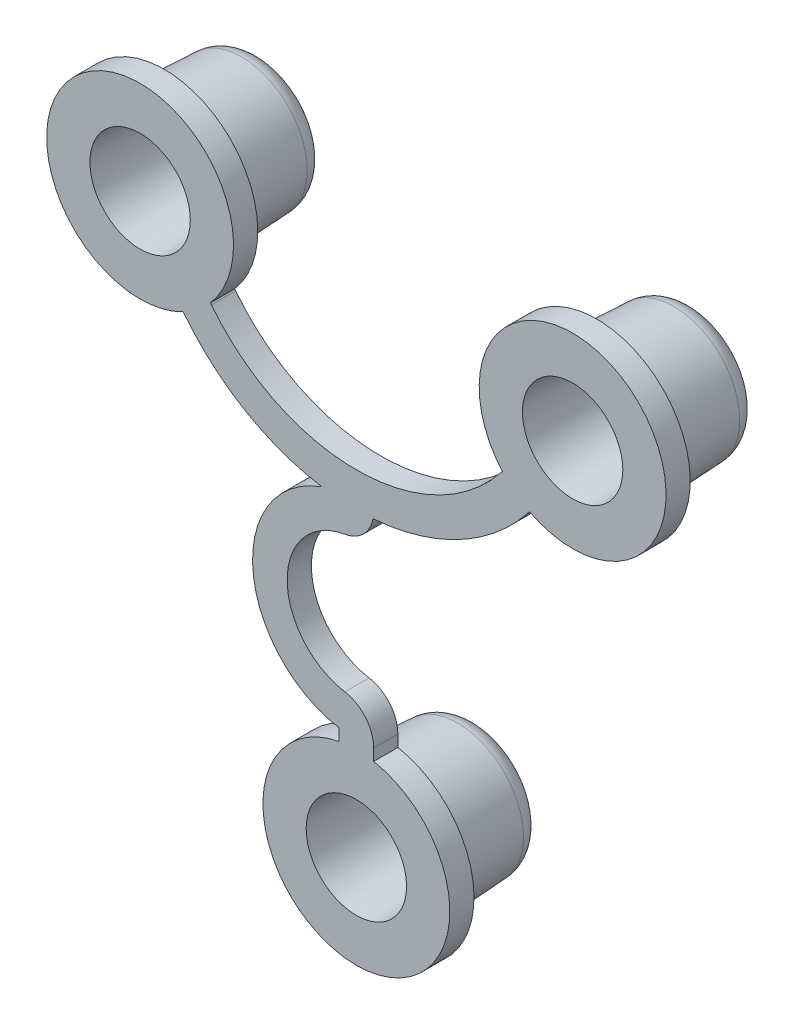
ISO-10303-21;
HEADER;
FILE_DESCRIPTION(('STEP AP214'),'2;1');
FILE_NAME('part.step','',(''),(''),'','','');
FILE_SCHEMA(('AUTOMOTIVE_DESIGN { 1 0 10303 214 1 1 1 1 }'));
ENDSEC;
DATA;
#1=APPLICATION_CONTEXT('core data for automotive mechanical design processes');
#2=APPLICATION_PROTOCOL_DEFINITION('international standard','automotive_design',2000,#1);
#3=PRODUCT_CONTEXT('',#1,'mechanical');
#4=PRODUCT('Part','Part','',(#3));
#5=PRODUCT_RELATED_PRODUCT_CATEGORY('part','',(#4));
#6=PRODUCT_DEFINITION_FORMATION('','',#4);
#7=PRODUCT_DEFINITION_CONTEXT('part definition',#1,'design');
#8=PRODUCT_DEFINITION('design','',#6,#7);
#9=PRODUCT_DEFINITION_SHAPE('','',#8);
#10=(LENGTH_UNIT() NAMED_UNIT(*) SI_UNIT(.MILLI.,.METRE.));
#11=(NAMED_UNIT(*) PLANE_ANGLE_UNIT() SI_UNIT($,.RADIAN.));
#12=(NAMED_UNIT(*) SI_UNIT($,.STERADIAN.) SOLID_ANGLE_UNIT());
#13=UNCERTAINTY_MEASURE_WITH_UNIT(LENGTH_MEASURE(1.E-05),#10,'distance_accuracy_value','');
#14=(GEOMETRIC_REPRESENTATION_CONTEXT(3) GLOBAL_UNCERTAINTY_ASSIGNED_CONTEXT((#13)) GLOBAL_UNIT_ASSIGNED_CONTEXT((#10,
#11,#12)) REPRESENTATION_CONTEXT('',''));
#15=CARTESIAN_POINT('',(0.,0.,0.));
#16=DIRECTION('',(0.,0.,1.));
#17=DIRECTION('',(1.,0.,0.));
#18=AXIS2_PLACEMENT_3D('',#15,#16,#17);
#19=CARTESIAN_POINT('',(-1.,17.8160797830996,14.9412181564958));
#20=DIRECTION('',(0.,0.,-1.));
#21=DIRECTION('',(0.,1.,0.));
#22=AXIS2_PLACEMENT_3D('',#19,#20,#21);
#23=CYLINDRICAL_SURFACE('',#22,2.);
#24=CARTESIAN_POINT('',(-1.,17.8160797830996,-1.4));
#25=DIRECTION('',(0.,0.,-1.));
#26=DIRECTION('',(-1.,0.,0.));
#27=AXIS2_PLACEMENT_3D('',#24,#25,#26);
#28=CIRCLE('',#27,2.);
#29=CARTESIAN_POINT('',(0.963698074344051,17.4367515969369,-1.4));
#30=VERTEX_POINT('',#29);
#31=CARTESIAN_POINT('',(-0.666666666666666,15.8440531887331,-1.4));
#32=VERTEX_POINT('',#31);
#33=EDGE_CURVE('E207',#30,#32,#28,.T.);
#34=ORIENTED_EDGE('',*,*,#33,.F.);
#35=DIRECTION('',(0.,0.,-1.));
#36=VECTOR('',#35,1.);
#37=CARTESIAN_POINT('',(0.963698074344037,17.4367515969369,-0.699999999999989));
#38=LINE('',#37,#36);
#39=CARTESIAN_POINT('',(0.963698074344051,17.4367515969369,0.));
#40=VERTEX_POINT('',#39);
#41=EDGE_CURVE('E171',#30,#40,#38,.F.);
#42=ORIENTED_EDGE('',*,*,#41,.T.);
#43=CARTESIAN_POINT('',(-1.,17.8160797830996,0.));
#44=DIRECTION('',(0.,0.,1.));
#45=DIRECTION('',(1.,0.,0.));
#46=AXIS2_PLACEMENT_3D('',#43,#44,#45);
#47=CIRCLE('',#46,2.);
#48=CARTESIAN_POINT('',(-0.666666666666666,15.8440531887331,0.));
#49=VERTEX_POINT('',#48);
#50=EDGE_CURVE('E228',#40,#49,#47,.F.);
#51=ORIENTED_EDGE('',*,*,#50,.T.);
#52=DIRECTION('',(0.,0.,-1.));
#53=VECTOR('',#52,1.);
#54=CARTESIAN_POINT('',(-0.666666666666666,15.8440531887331,14.9412181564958));
#55=LINE('',#54,#53);
#56=EDGE_CURVE('E220',#49,#32,#55,.T.);
#57=ORIENTED_EDGE('',*,*,#56,.T.);
#58=EDGE_LOOP('',(#34,#42,#51,#57));
#59=FACE_BOUND('',#58,.T.);
#60=ADVANCED_FACE('F36',(#59),#23,.T.);
#61=CARTESIAN_POINT('',(0.,11.9,14.9412181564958));
#62=DIRECTION('',(0.,0.,-1.));
#63=DIRECTION('',(0.,1.,0.));
#64=AXIS2_PLACEMENT_3D('',#61,#62,#63);
#65=CYLINDRICAL_SURFACE('',#64,6.);
#66=DIRECTION('',(0.,0.,-1.));
#67=VECTOR('',#66,1.);
#68=CARTESIAN_POINT('',(-1.99570021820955,17.5583726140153,-0.699999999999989));
#69=LINE('',#68,#67);
#70=CARTESIAN_POINT('',(-1.99570021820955,17.5583726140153,-1.4));
#71=VERTEX_POINT('',#70);
#72=CARTESIAN_POINT('',(-1.99570021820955,17.5583726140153,0.));
#73=VERTEX_POINT('',#72);
#74=EDGE_CURVE('E271',#71,#73,#69,.F.);
#75=ORIENTED_EDGE('',*,*,#74,.F.);
#76=CARTESIAN_POINT('',(0.,11.9,-1.4));
#77=DIRECTION('',(0.,0.,-1.));
#78=DIRECTION('',(-1.,0.,0.));
#79=AXIS2_PLACEMENT_3D('',#76,#77,#78);
#80=CIRCLE('',#79,6.);
#81=CARTESIAN_POINT('',(-1.,5.98392021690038,-1.4));
#82=VERTEX_POINT('',#81);
#83=EDGE_CURVE('E217',#71,#82,#80,.F.);
#84=ORIENTED_EDGE('',*,*,#83,.T.);
#85=DIRECTION('',(0.,0.,-1.));
#86=VECTOR('',#85,1.);
#87=CARTESIAN_POINT('',(-1.,5.98392021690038,14.9412181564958));
#88=LINE('',#87,#86);
#89=CARTESIAN_POINT('',(-1.,5.98392021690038,0.));
#90=VERTEX_POINT('',#89);
#91=EDGE_CURVE('E219',#90,#82,#88,.T.);
#92=ORIENTED_EDGE('',*,*,#91,.F.);
#93=CARTESIAN_POINT('',(0.,11.9,0.));
#94=DIRECTION('',(0.,0.,1.));
#95=DIRECTION('',(1.,0.,0.));
#96=AXIS2_PLACEMENT_3D('',#93,#94,#95);
#97=CIRCLE('',#96,6.);
#98=EDGE_CURVE('E212',#73,#90,#97,.T.);
#99=ORIENTED_EDGE('',*,*,#98,.F.);
#100=EDGE_LOOP('',(#75,#84,#92,#99));
#101=FACE_BOUND('',#100,.T.);
#102=ADVANCED_FACE('F355',(#101),#65,.T.);
#103=CARTESIAN_POINT('',(0.,0.,0.));
#104=DIRECTION('',(0.,0.,1.));
#105=DIRECTION('',(1.,0.,0.));
#106=AXIS2_PLACEMENT_3D('',#103,#104,#105);
#107=CONICAL_SURFACE('',#106,2.90108311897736,0.0523598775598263);
#108=CARTESIAN_POINT('',(0.,0.,-5.8));
#109=DIRECTION('',(0.,0.,-1.));
#110=DIRECTION('',(-1.,0.,0.));
#111=AXIS2_PLACEMENT_3D('',#108,#109,#110);
#112=CIRCLE('',#111,2.59711799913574);
#113=CARTESIAN_POINT('',(-2.59711799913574,0.,-5.8));
#114=VERTEX_POINT('',#113);
#115=EDGE_CURVE('E268',#114,#114,#112,.T.);
#116=ORIENTED_EDGE('',*,*,#115,.T.);
#117=EDGE_LOOP('',(#116));
#118=FACE_BOUND('',#117,.T.);
#119=CARTESIAN_POINT('',(0.,0.,0.));
#120=DIRECTION('',(0.,0.,-1.));
#121=DIRECTION('',(-1.,0.,0.));
#122=AXIS2_PLACEMENT_3D('',#119,#120,#121);
#123=CIRCLE('',#122,2.90108311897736);
#124=CARTESIAN_POINT('',(-2.90108311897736,0.,0.));
#125=VERTEX_POINT('',#124);
#126=EDGE_CURVE('E248',#125,#125,#123,.T.);
#127=ORIENTED_EDGE('',*,*,#126,.F.);
#128=EDGE_LOOP('',(#127));
#129=FACE_BOUND('',#128,.T.);
#130=ADVANCED_FACE('F38',(#118,#129),#107,.F.);
#131=CARTESIAN_POINT('',(2.59711799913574,0.,-5.8));
#132=DIRECTION('',(0.,0.,1.));
#133=DIRECTION('',(1.,0.,0.));
#134=AXIS2_PLACEMENT_3D('',#131,#132,#133);
#135=PLANE('',#134);
#136=ORIENTED_EDGE('',*,*,#115,.F.);
#137=EDGE_LOOP('',(#136));
#138=FACE_BOUND('',#137,.T.);
#139=ADVANCED_FACE('F401',(#138),#135,.T.);
#140=CARTESIAN_POINT('',(0.,0.,-7.));
#141=DIRECTION('',(0.,0.,-1.));
#142=DIRECTION('',(-1.,0.,0.));
#143=AXIS2_PLACEMENT_3D('',#140,#141,#142);
#144=PLANE('',#143);
#145=CARTESIAN_POINT('',(0.,0.,-7.));
#146=DIRECTION('',(0.,0.,-1.));
#147=DIRECTION('',(-1.,0.,0.));
#148=AXIS2_PLACEMENT_3D('',#145,#146,#147);
#149=CIRCLE('',#148,2.59711799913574);
#150=CARTESIAN_POINT('',(-2.59711799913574,0.,-7.));
#151=VERTEX_POINT('',#150);
#152=EDGE_CURVE('E265',#151,#151,#149,.T.);
#153=ORIENTED_EDGE('',*,*,#152,.T.);
#154=EDGE_LOOP('',(#153));
#155=FACE_BOUND('',#154,.T.);
#156=ADVANCED_FACE('F398',(#155),#144,.T.);
#157=CARTESIAN_POINT('',(0.,0.,-5.8));
#158=DIRECTION('',(0.,0.,-1.));
#159=DIRECTION('',(-1.,0.,0.));
#160=AXIS2_PLACEMENT_3D('',#157,#158,#159);
#161=TOROIDAL_SURFACE('',#160,2.59711799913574,1.2);
#162=CARTESIAN_POINT('',(0.,0.,-5.86280314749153));
#163=DIRECTION('',(0.,0.,-1.));
#164=DIRECTION('',(-1.,0.,0.));
#165=AXIS2_PLACEMENT_3D('',#162,#163,#164);
#166=CIRCLE('',#165,3.79547344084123);
#167=CARTESIAN_POINT('',(-3.79547344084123,0.,-5.86280314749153));
#168=VERTEX_POINT('',#167);
#169=EDGE_CURVE('E262',#168,#168,#166,.T.);
#170=ORIENTED_EDGE('',*,*,#169,.T.);
#171=EDGE_LOOP('',(#170));
#172=FACE_BOUND('',#171,.T.);
#173=ORIENTED_EDGE('',*,*,#152,.F.);
#174=EDGE_LOOP('',(#173));
#175=FACE_BOUND('',#174,.T.);
#176=ADVANCED_FACE('F394',(#172,#175),#161,.T.);
#177=CARTESIAN_POINT('',(0.,0.,-5.86280314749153));
#178=DIRECTION('',(0.,0.,1.));
#179=DIRECTION('',(1.,0.,0.));
#180=AXIS2_PLACEMENT_3D('',#177,#178,#179);
#181=CONICAL_SURFACE('',#180,3.79547344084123,0.0523598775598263);
#182=CARTESIAN_POINT('',(0.,0.,-1.87383202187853));
#183=DIRECTION('',(0.,0.,-1.));
#184=DIRECTION('',(-1.,0.,0.));
#185=AXIS2_PLACEMENT_3D('',#182,#183,#184);
#186=CIRCLE('',#185,4.00452655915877);
#187=CARTESIAN_POINT('',(-4.00452655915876,0.,-1.87383202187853));
#188=VERTEX_POINT('',#187);
#189=EDGE_CURVE('E259',#188,#188,#186,.T.);
#190=ORIENTED_EDGE('',*,*,#189,.T.);
#191=EDGE_LOOP('',(#190));
#192=FACE_BOUND('',#191,.T.);
#193=ORIENTED_EDGE('',*,*,#169,.F.);
#194=EDGE_LOOP('',(#193));
#195=FACE_BOUND('',#194,.T.);
#196=ADVANCED_FACE('F390',(#192,#195),#181,.T.);
#197=CARTESIAN_POINT('',(0.,0.,-1.9));
#198=DIRECTION('',(0.,0.,-1.));
#199=DIRECTION('',(-1.,0.,0.));
#200=AXIS2_PLACEMENT_3D('',#197,#198,#199);
#201=TOROIDAL_SURFACE('',#200,4.50384132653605,0.5);
#202=CARTESIAN_POINT('',(0.,0.,-1.4));
#203=DIRECTION('',(0.,0.,-1.));
#204=DIRECTION('',(-1.,0.,0.));
#205=AXIS2_PLACEMENT_3D('',#202,#203,#204);
#206=CIRCLE('',#205,4.50384132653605);
#207=CARTESIAN_POINT('',(-4.50384132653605,0.,-1.4));
#208=VERTEX_POINT('',#207);
#209=EDGE_CURVE('E256',#208,#208,#206,.T.);
#210=ORIENTED_EDGE('',*,*,#209,.T.);
#211=EDGE_LOOP('',(#210));
#212=FACE_BOUND('',#211,.T.);
#213=ORIENTED_EDGE('',*,*,#189,.F.);
#214=EDGE_LOOP('',(#213));
#215=FACE_BOUND('',#214,.T.);
#216=ADVANCED_FACE('F387',(#212,#215),#201,.F.);
#217=CARTESIAN_POINT('',(4.50384132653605,0.,-1.4));
#218=DIRECTION('',(0.,0.,-1.));
#219=DIRECTION('',(-1.,0.,0.));
#220=AXIS2_PLACEMENT_3D('',#217,#218,#219);
#221=PLANE('',#220);
#222=DIRECTION('',(0.617691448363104,0.78642054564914,0.));
#223=VECTOR('',#222,1.);
#224=CARTESIAN_POINT('',(8.37804563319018,23.4728825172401,-1.4));
#225=LINE('',#224,#223);
#226=CARTESIAN_POINT('',(8.37804563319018,23.4728825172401,-1.4));
#227=VERTEX_POINT('',#226);
#228=CARTESIAN_POINT('',(8.43573822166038,23.5463344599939,-1.4));
#229=VERTEX_POINT('',#228);
#230=EDGE_CURVE('E178',#227,#229,#225,.T.);
#231=ORIENTED_EDGE('',*,*,#230,.T.);
#232=CARTESIAN_POINT('',(12.5,27.1018620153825,-1.4));
#233=DIRECTION('',(0.,0.,-1.));
#234=DIRECTION('',(0.819152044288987,-0.573576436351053,0.));
#235=AXIS2_PLACEMENT_3D('',#232,#233,#234);
#236=CIRCLE('',#235,5.4);
#237=CARTESIAN_POINT('',(10.0085793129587,22.3109515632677,-1.4));
#238=VERTEX_POINT('',#237);
#239=EDGE_CURVE('E155',#229,#238,#236,.T.);
#240=ORIENTED_EDGE('',*,*,#239,.T.);
#241=DIRECTION('',(0.617691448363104,0.78642054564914,0.));
#242=VECTOR('',#241,1.);
#243=CARTESIAN_POINT('',(9.95088672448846,22.2374996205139,-1.4));
#244=LINE('',#243,#242);
#245=CARTESIAN_POINT('',(9.95088672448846,22.2374996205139,-1.4));
#246=VERTEX_POINT('',#245);
#247=EDGE_CURVE('E166',#246,#238,#244,.T.);
#248=ORIENTED_EDGE('',*,*,#247,.F.);
#249=CARTESIAN_POINT('',(0.,30.0533910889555,-1.4));
#250=DIRECTION('',(0.,0.,-1.));
#251=DIRECTION('',(-1.,0.,0.));
#252=AXIS2_PLACEMENT_3D('',#249,#250,#251);
#253=CIRCLE('',#252,12.6533910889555);
#254=EDGE_CURVE('E200',#30,#246,#253,.F.);
#255=ORIENTED_EDGE('',*,*,#254,.F.);
#256=ORIENTED_EDGE('',*,*,#33,.T.);
#257=CARTESIAN_POINT('',(0.,11.9,-1.4));
#258=DIRECTION('',(0.,0.,-1.));
#259=DIRECTION('',(-1.,0.,0.));
#260=AXIS2_PLACEMENT_3D('',#257,#258,#259);
#261=CIRCLE('',#260,4.);
#262=CARTESIAN_POINT('',(-0.666666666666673,7.95594681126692,-1.4));
#263=VERTEX_POINT('',#262);
#264=EDGE_CURVE('E213',#32,#263,#261,.F.);
#265=ORIENTED_EDGE('',*,*,#264,.T.);
#266=CARTESIAN_POINT('',(-1.,5.98392021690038,-1.4));
#267=DIRECTION('',(0.,0.,-1.));
#268=DIRECTION('',(-1.,0.,0.));
#269=AXIS2_PLACEMENT_3D('',#266,#267,#268);
#270=CIRCLE('',#269,2.);
#271=CARTESIAN_POINT('',(1.,5.98392021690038,-1.4));
#272=VERTEX_POINT('',#271);
#273=EDGE_CURVE('E209',#263,#272,#270,.T.);
#274=ORIENTED_EDGE('',*,*,#273,.T.);
#275=DIRECTION('',(0.,-1.,0.));
#276=VECTOR('',#275,1.);
#277=CARTESIAN_POINT('',(1.,5.4,-1.4));
#278=LINE('',#277,#276);
#279=CARTESIAN_POINT('',(1.,5.30659966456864,-1.4));
#280=VERTEX_POINT('',#279);
#281=EDGE_CURVE('E204',#272,#280,#278,.T.);
#282=ORIENTED_EDGE('',*,*,#281,.T.);
#283=CARTESIAN_POINT('',(0.,0.,-1.4));
#284=DIRECTION('',(0.,0.,-1.));
#285=DIRECTION('',(-1.,0.,0.));
#286=AXIS2_PLACEMENT_3D('',#283,#284,#285);
#287=CIRCLE('',#286,5.4);
#288=CARTESIAN_POINT('',(-1.,5.30659966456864,-1.4));
#289=VERTEX_POINT('',#288);
#290=EDGE_CURVE('E253',#280,#289,#287,.T.);
#291=ORIENTED_EDGE('',*,*,#290,.T.);
#292=DIRECTION('',(0.,-1.,0.));
#293=VECTOR('',#292,1.);
#294=CARTESIAN_POINT('',(-1.,5.4,-1.4));
#295=LINE('',#294,#293);
#296=EDGE_CURVE('E208',#82,#289,#295,.T.);
#297=ORIENTED_EDGE('',*,*,#296,.F.);
#298=ORIENTED_EDGE('',*,*,#83,.F.);
#299=CARTESIAN_POINT('',(-9.95088672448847,22.2374996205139,-1.4));
#300=VERTEX_POINT('',#299);
#301=EDGE_CURVE('E202',#300,#71,#253,.F.);
#302=ORIENTED_EDGE('',*,*,#301,.F.);
#303=DIRECTION('',(0.617691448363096,-0.786420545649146,0.));
#304=VECTOR('',#303,1.);
#305=CARTESIAN_POINT('',(-9.95088672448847,22.2374996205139,-1.4));
#306=LINE('',#305,#304);
#307=CARTESIAN_POINT('',(-10.0085793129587,22.3109515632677,-1.4));
#308=VERTEX_POINT('',#307);
#309=EDGE_CURVE('E196',#308,#300,#306,.T.);
#310=ORIENTED_EDGE('',*,*,#309,.F.);
#311=CARTESIAN_POINT('',(-12.5,27.1018620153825,-1.4));
#312=DIRECTION('',(0.,0.,-1.));
#313=DIRECTION('',(0.819152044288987,0.573576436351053,0.));
#314=AXIS2_PLACEMENT_3D('',#311,#312,#313);
#315=CIRCLE('',#314,5.4);
#316=CARTESIAN_POINT('',(-8.43573822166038,23.5463344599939,-1.4));
#317=VERTEX_POINT('',#316);
#318=EDGE_CURVE('E285',#308,#317,#315,.T.);
#319=ORIENTED_EDGE('',*,*,#318,.T.);
#320=DIRECTION('',(0.617691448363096,-0.786420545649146,0.));
#321=VECTOR('',#320,1.);
#322=CARTESIAN_POINT('',(-8.37804563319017,23.4728825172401,-1.4));
#323=LINE('',#322,#321);
#324=CARTESIAN_POINT('',(-8.37804563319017,23.4728825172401,-1.4));
#325=VERTEX_POINT('',#324);
#326=EDGE_CURVE('E291',#317,#325,#323,.T.);
#327=ORIENTED_EDGE('',*,*,#326,.T.);
#328=CARTESIAN_POINT('',(0.,30.0533910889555,-1.4));
#329=DIRECTION('',(0.,0.,-1.));
#330=DIRECTION('',(-1.,0.,0.));
#331=AXIS2_PLACEMENT_3D('',#328,#329,#330);
#332=CIRCLE('',#331,10.6533910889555);
#333=EDGE_CURVE('E183',#325,#227,#332,.F.);
#334=ORIENTED_EDGE('',*,*,#333,.T.);
#335=EDGE_LOOP('',(#231,#240,#248,#255,#256,#265,#274,#282,#291,#297,#298,#302,#310,#319,#327,#334));
#336=FACE_BOUND('',#335,.T.);
#337=ORIENTED_EDGE('',*,*,#209,.F.);
#338=EDGE_LOOP('',(#337));
#339=FACE_BOUND('',#338,.T.);
#340=CARTESIAN_POINT('',(-12.5,27.1018620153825,-1.4));
#341=DIRECTION('',(0.,0.,-1.));
#342=DIRECTION('',(0.819152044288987,0.573576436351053,0.));
#343=AXIS2_PLACEMENT_3D('',#340,#341,#342);
#344=CIRCLE('',#343,4.50384132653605);
#345=CARTESIAN_POINT('',(-8.81066917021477,29.6851592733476,-1.4));
#346=VERTEX_POINT('',#345);
#347=EDGE_CURVE('E310',#346,#346,#344,.T.);
#348=ORIENTED_EDGE('',*,*,#347,.F.);
#349=EDGE_LOOP('',(#348));
#350=FACE_BOUND('',#349,.T.);
#351=CARTESIAN_POINT('',(12.5,27.1018620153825,-1.4));
#352=DIRECTION('',(0.,0.,-1.));
#353=DIRECTION('',(0.819152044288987,-0.573576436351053,0.));
#354=AXIS2_PLACEMENT_3D('',#351,#352,#353);
#355=CIRCLE('',#354,4.50384132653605);
#356=CARTESIAN_POINT('',(16.1893308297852,24.5185647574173,-1.4));
#357=VERTEX_POINT('',#356);
#358=EDGE_CURVE('E331',#357,#357,#355,.T.);
#359=ORIENTED_EDGE('',*,*,#358,.F.);
#360=EDGE_LOOP('',(#359));
#361=FACE_BOUND('',#360,.T.);
#362=ADVANCED_FACE('F283',(#336,#339,#350,#361),#221,.T.);
#363=CARTESIAN_POINT('',(0.,0.,0.));
#364=DIRECTION('',(0.,0.,-1.));
#365=DIRECTION('',(-1.,0.,0.));
#366=AXIS2_PLACEMENT_3D('',#363,#364,#365);
#367=CYLINDRICAL_SURFACE('',#366,5.4);
#368=DIRECTION('',(0.,0.,-1.));
#369=VECTOR('',#368,1.);
#370=CARTESIAN_POINT('',(1.,5.30659966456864,0.));
#371=LINE('',#370,#369);
#372=CARTESIAN_POINT('',(1.,5.30659966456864,0.));
#373=VERTEX_POINT('',#372);
#374=EDGE_CURVE('E245',#373,#280,#371,.T.);
#375=ORIENTED_EDGE('',*,*,#374,.F.);
#376=CARTESIAN_POINT('',(0.,0.,0.));
#377=DIRECTION('',(0.,0.,-1.));
#378=DIRECTION('',(-1.,0.,0.));
#379=AXIS2_PLACEMENT_3D('',#376,#377,#378);
#380=CIRCLE('',#379,5.4);
#381=CARTESIAN_POINT('',(-1.,5.30659966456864,0.));
#382=VERTEX_POINT('',#381);
#383=EDGE_CURVE('E251',#373,#382,#380,.T.);
#384=ORIENTED_EDGE('',*,*,#383,.T.);
#385=DIRECTION('',(0.,0.,-1.));
#386=VECTOR('',#385,1.);
#387=CARTESIAN_POINT('',(-1.,5.30659966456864,0.));
#388=LINE('',#387,#386);
#389=EDGE_CURVE('E226',#382,#289,#388,.T.);
#390=ORIENTED_EDGE('',*,*,#389,.T.);
#391=ORIENTED_EDGE('',*,*,#290,.F.);
#392=EDGE_LOOP('',(#375,#384,#390,#391));
#393=FACE_BOUND('',#392,.T.);
#394=ADVANCED_FACE('F381',(#393),#367,.T.);
#395=CARTESIAN_POINT('',(5.4,0.,0.));
#396=DIRECTION('',(0.,0.,1.));
#397=DIRECTION('',(1.,0.,0.));
#398=AXIS2_PLACEMENT_3D('',#395,#396,#397);
#399=PLANE('',#398);
#400=DIRECTION('',(0.617691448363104,0.78642054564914,0.));
#401=VECTOR('',#400,1.);
#402=CARTESIAN_POINT('',(9.95088672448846,22.2374996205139,0.));
#403=LINE('',#402,#401);
#404=CARTESIAN_POINT('',(9.95088672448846,22.2374996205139,0.));
#405=VERTEX_POINT('',#404);
#406=CARTESIAN_POINT('',(10.0085793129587,22.3109515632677,0.));
#407=VERTEX_POINT('',#406);
#408=EDGE_CURVE('E163',#405,#407,#403,.T.);
#409=ORIENTED_EDGE('',*,*,#408,.T.);
#410=CARTESIAN_POINT('',(12.5,27.1018620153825,0.));
#411=DIRECTION('',(0.,0.,-1.));
#412=DIRECTION('',(0.819152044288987,-0.573576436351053,0.));
#413=AXIS2_PLACEMENT_3D('',#410,#411,#412);
#414=CIRCLE('',#413,5.4);
#415=CARTESIAN_POINT('',(8.43573822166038,23.5463344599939,0.));
#416=VERTEX_POINT('',#415);
#417=EDGE_CURVE('E147',#416,#407,#414,.T.);
#418=ORIENTED_EDGE('',*,*,#417,.F.);
#419=DIRECTION('',(0.617691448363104,0.78642054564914,0.));
#420=VECTOR('',#419,1.);
#421=CARTESIAN_POINT('',(8.37804563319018,23.4728825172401,0.));
#422=LINE('',#421,#420);
#423=CARTESIAN_POINT('',(8.37804563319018,23.4728825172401,0.));
#424=VERTEX_POINT('',#423);
#425=EDGE_CURVE('E190',#424,#416,#422,.T.);
#426=ORIENTED_EDGE('',*,*,#425,.F.);
#427=CARTESIAN_POINT('',(0.,30.0533910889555,0.));
#428=DIRECTION('',(0.,0.,1.));
#429=DIRECTION('',(1.,0.,0.));
#430=AXIS2_PLACEMENT_3D('',#427,#428,#429);
#431=CIRCLE('',#430,10.6533910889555);
#432=CARTESIAN_POINT('',(-8.37804563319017,23.4728825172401,0.));
#433=VERTEX_POINT('',#432);
#434=EDGE_CURVE('E188',#433,#424,#431,.T.);
#435=ORIENTED_EDGE('',*,*,#434,.F.);
#436=DIRECTION('',(0.617691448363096,-0.786420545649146,0.));
#437=VECTOR('',#436,1.);
#438=CARTESIAN_POINT('',(-8.37804563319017,23.4728825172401,0.));
#439=LINE('',#438,#437);
#440=CARTESIAN_POINT('',(-8.43573822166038,23.5463344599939,0.));
#441=VERTEX_POINT('',#440);
#442=EDGE_CURVE('E184',#441,#433,#439,.T.);
#443=ORIENTED_EDGE('',*,*,#442,.F.);
#444=CARTESIAN_POINT('',(-12.5,27.1018620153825,0.));
#445=DIRECTION('',(0.,0.,-1.));
#446=DIRECTION('',(0.819152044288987,0.573576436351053,0.));
#447=AXIS2_PLACEMENT_3D('',#444,#445,#446);
#448=CIRCLE('',#447,5.4);
#449=CARTESIAN_POINT('',(-10.0085793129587,22.3109515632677,0.));
#450=VERTEX_POINT('',#449);
#451=EDGE_CURVE('E51',#450,#441,#448,.T.);
#452=ORIENTED_EDGE('',*,*,#451,.F.);
#453=DIRECTION('',(0.617691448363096,-0.786420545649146,0.));
#454=VECTOR('',#453,1.);
#455=CARTESIAN_POINT('',(-9.95088672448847,22.2374996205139,0.));
#456=LINE('',#455,#454);
#457=CARTESIAN_POINT('',(-9.95088672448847,22.2374996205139,0.));
#458=VERTEX_POINT('',#457);
#459=EDGE_CURVE('E181',#450,#458,#456,.T.);
#460=ORIENTED_EDGE('',*,*,#459,.T.);
#461=CARTESIAN_POINT('',(0.,30.0533910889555,0.));
#462=DIRECTION('',(0.,0.,1.));
#463=DIRECTION('',(1.,0.,0.));
#464=AXIS2_PLACEMENT_3D('',#461,#462,#463);
#465=CIRCLE('',#464,12.6533910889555);
#466=EDGE_CURVE('E57',#458,#73,#465,.T.);
#467=ORIENTED_EDGE('',*,*,#466,.T.);
#468=ORIENTED_EDGE('',*,*,#98,.T.);
#469=DIRECTION('',(0.,-1.,0.));
#470=VECTOR('',#469,1.);
#471=CARTESIAN_POINT('',(-1.,5.4,0.));
#472=LINE('',#471,#470);
#473=EDGE_CURVE('E223',#90,#382,#472,.T.);
#474=ORIENTED_EDGE('',*,*,#473,.T.);
#475=ORIENTED_EDGE('',*,*,#383,.F.);
#476=DIRECTION('',(0.,-1.,0.));
#477=VECTOR('',#476,1.);
#478=CARTESIAN_POINT('',(1.,5.4,0.));
#479=LINE('',#478,#477);
#480=CARTESIAN_POINT('',(1.,5.98392021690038,0.));
#481=VERTEX_POINT('',#480);
#482=EDGE_CURVE('E174',#481,#373,#479,.T.);
#483=ORIENTED_EDGE('',*,*,#482,.F.);
#484=CARTESIAN_POINT('',(-1.,5.98392021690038,0.));
#485=DIRECTION('',(0.,0.,1.));
#486=DIRECTION('',(1.,0.,0.));
#487=AXIS2_PLACEMENT_3D('',#484,#485,#486);
#488=CIRCLE('',#487,2.);
#489=CARTESIAN_POINT('',(-0.666666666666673,7.95594681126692,0.));
#490=VERTEX_POINT('',#489);
#491=EDGE_CURVE('E234',#490,#481,#488,.F.);
#492=ORIENTED_EDGE('',*,*,#491,.F.);
#493=CARTESIAN_POINT('',(0.,11.9,0.));
#494=DIRECTION('',(0.,0.,1.));
#495=DIRECTION('',(1.,0.,0.));
#496=AXIS2_PLACEMENT_3D('',#493,#494,#495);
#497=CIRCLE('',#496,4.);
#498=EDGE_CURVE('E231',#49,#490,#497,.T.);
#499=ORIENTED_EDGE('',*,*,#498,.F.);
#500=ORIENTED_EDGE('',*,*,#50,.F.);
#501=EDGE_CURVE('E170',#40,#405,#465,.T.);
#502=ORIENTED_EDGE('',*,*,#501,.T.);
#503=EDGE_LOOP('',(#409,#418,#426,#435,#443,#452,#460,#467,#468,#474,#475,#483,#492,#499,#500,#502));
#504=FACE_BOUND('',#503,.T.);
#505=ORIENTED_EDGE('',*,*,#126,.T.);
#506=EDGE_LOOP('',(#505));
#507=FACE_BOUND('',#506,.T.);
#508=CARTESIAN_POINT('',(-12.5,27.1018620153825,0.));
#509=DIRECTION('',(0.,0.,-1.));
#510=DIRECTION('',(0.819152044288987,0.573576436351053,0.));
#511=AXIS2_PLACEMENT_3D('',#508,#509,#510);
#512=CIRCLE('',#511,2.90108311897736);
#513=CARTESIAN_POINT('',(-10.1235718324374,28.7658549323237,0.));
#514=VERTEX_POINT('',#513);
#515=EDGE_CURVE('E315',#514,#514,#512,.T.);
#516=ORIENTED_EDGE('',*,*,#515,.T.);
#517=EDGE_LOOP('',(#516));
#518=FACE_BOUND('',#517,.T.);
#519=CARTESIAN_POINT('',(12.5,27.1018620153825,0.));
#520=DIRECTION('',(0.,0.,-1.));
#521=DIRECTION('',(0.819152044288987,-0.573576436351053,0.));
#522=AXIS2_PLACEMENT_3D('',#519,#520,#521);
#523=CIRCLE('',#522,2.90108311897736);
#524=CARTESIAN_POINT('',(14.8764281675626,25.4378690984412,0.));
#525=VERTEX_POINT('',#524);
#526=EDGE_CURVE('E156',#525,#525,#523,.T.);
#527=ORIENTED_EDGE('',*,*,#526,.T.);
#528=EDGE_LOOP('',(#527));
#529=FACE_BOUND('',#528,.T.);
#530=ADVANCED_FACE('F167',(#504,#507,#518,#529),#399,.T.);
#531=CARTESIAN_POINT('',(1.,5.4,14.9412181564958));
#532=DIRECTION('',(1.,0.,0.));
#533=DIRECTION('',(0.,0.,-1.));
#534=AXIS2_PLACEMENT_3D('',#531,#532,#533);
#535=PLANE('',#534);
#536=ORIENTED_EDGE('',*,*,#482,.T.);
#537=ORIENTED_EDGE('',*,*,#374,.T.);
#538=ORIENTED_EDGE('',*,*,#281,.F.);
#539=DIRECTION('',(0.,0.,-1.));
#540=VECTOR('',#539,1.);
#541=CARTESIAN_POINT('',(1.,5.98392021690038,14.9412181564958));
#542=LINE('',#541,#540);
#543=EDGE_CURVE('E233',#481,#272,#542,.T.);
#544=ORIENTED_EDGE('',*,*,#543,.F.);
#545=EDGE_LOOP('',(#536,#537,#538,#544));
#546=FACE_BOUND('',#545,.T.);
#547=ADVANCED_FACE('F374',(#546),#535,.T.);
#548=CARTESIAN_POINT('',(-1.,5.98392021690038,14.9412181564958));
#549=DIRECTION('',(0.,0.,-1.));
#550=DIRECTION('',(0.,1.,0.));
#551=AXIS2_PLACEMENT_3D('',#548,#549,#550);
#552=CYLINDRICAL_SURFACE('',#551,2.);
#553=DIRECTION('',(0.,0.,-1.));
#554=VECTOR('',#553,1.);
#555=CARTESIAN_POINT('',(-0.666666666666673,7.95594681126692,14.9412181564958));
#556=LINE('',#555,#554);
#557=EDGE_CURVE('E230',#490,#263,#556,.T.);
#558=ORIENTED_EDGE('',*,*,#557,.F.);
#559=ORIENTED_EDGE('',*,*,#491,.T.);
#560=ORIENTED_EDGE('',*,*,#543,.T.);
#561=ORIENTED_EDGE('',*,*,#273,.F.);
#562=EDGE_LOOP('',(#558,#559,#560,#561));
#563=FACE_BOUND('',#562,.T.);
#564=ADVANCED_FACE('F370',(#563),#552,.T.);
#565=CARTESIAN_POINT('',(0.,11.9,14.9412181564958));
#566=DIRECTION('',(0.,0.,-1.));
#567=DIRECTION('',(0.,1.,0.));
#568=AXIS2_PLACEMENT_3D('',#565,#566,#567);
#569=CYLINDRICAL_SURFACE('',#568,4.);
#570=ORIENTED_EDGE('',*,*,#56,.F.);
#571=ORIENTED_EDGE('',*,*,#498,.T.);
#572=ORIENTED_EDGE('',*,*,#557,.T.);
#573=ORIENTED_EDGE('',*,*,#264,.F.);
#574=EDGE_LOOP('',(#570,#571,#572,#573));
#575=FACE_BOUND('',#574,.T.);
#576=ADVANCED_FACE('F366',(#575),#569,.F.);
#577=CARTESIAN_POINT('',(-1.,5.4,14.9412181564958));
#578=DIRECTION('',(1.,0.,0.));
#579=DIRECTION('',(0.,0.,-1.));
#580=AXIS2_PLACEMENT_3D('',#577,#578,#579);
#581=PLANE('',#580);
#582=ORIENTED_EDGE('',*,*,#389,.F.);
#583=ORIENTED_EDGE('',*,*,#473,.F.);
#584=ORIENTED_EDGE('',*,*,#91,.T.);
#585=ORIENTED_EDGE('',*,*,#296,.T.);
#586=EDGE_LOOP('',(#582,#583,#584,#585));
#587=FACE_BOUND('',#586,.T.);
#588=ADVANCED_FACE('F369',(#587),#581,.F.);
#589=CARTESIAN_POINT('',(0.,30.0533910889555,21.09007192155));
#590=DIRECTION('',(0.,0.,-1.));
#591=DIRECTION('',(0.,1.,0.));
#592=AXIS2_PLACEMENT_3D('',#589,#590,#591);
#593=CYLINDRICAL_SURFACE('',#592,12.6533910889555);
#594=ORIENTED_EDGE('',*,*,#301,.T.);
#595=ORIENTED_EDGE('',*,*,#74,.T.);
#596=ORIENTED_EDGE('',*,*,#466,.F.);
#597=DIRECTION('',(0.,0.,-1.));
#598=VECTOR('',#597,1.);
#599=CARTESIAN_POINT('',(-9.95088672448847,22.2374996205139,21.09007192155));
#600=LINE('',#599,#598);
#601=EDGE_CURVE('E197',#458,#300,#600,.T.);
#602=ORIENTED_EDGE('',*,*,#601,.T.);
#603=EDGE_LOOP('',(#594,#595,#596,#602));
#604=FACE_BOUND('',#603,.T.);
#605=ADVANCED_FACE('F434',(#604),#593,.T.);
#606=CARTESIAN_POINT('',(8.37804563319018,23.4728825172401,21.09007192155));
#607=DIRECTION('',(-0.786420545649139,0.617691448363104,0.));
#608=DIRECTION('',(-0.617691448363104,-0.78642054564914,0.));
#609=AXIS2_PLACEMENT_3D('',#606,#607,#608);
#610=PLANE('',#609);
#611=DIRECTION('',(0.,0.,-1.));
#612=VECTOR('',#611,1.);
#613=CARTESIAN_POINT('',(8.43573822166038,23.5463344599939,0.));
#614=LINE('',#613,#612);
#615=EDGE_CURVE('E151',#229,#416,#614,.F.);
#616=ORIENTED_EDGE('',*,*,#615,.F.);
#617=ORIENTED_EDGE('',*,*,#230,.F.);
#618=DIRECTION('',(0.,0.,-1.));
#619=VECTOR('',#618,1.);
#620=CARTESIAN_POINT('',(8.37804563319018,23.4728825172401,21.09007192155));
#621=LINE('',#620,#619);
#622=EDGE_CURVE('E187',#424,#227,#621,.T.);
#623=ORIENTED_EDGE('',*,*,#622,.F.);
#624=ORIENTED_EDGE('',*,*,#425,.T.);
#625=EDGE_LOOP('',(#616,#617,#623,#624));
#626=FACE_BOUND('',#625,.T.);
#627=ADVANCED_FACE('F444',(#626),#610,.T.);
#628=CARTESIAN_POINT('',(0.,30.0533910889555,21.09007192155));
#629=DIRECTION('',(0.,0.,-1.));
#630=DIRECTION('',(0.,1.,0.));
#631=AXIS2_PLACEMENT_3D('',#628,#629,#630);
#632=CYLINDRICAL_SURFACE('',#631,10.6533910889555);
#633=DIRECTION('',(0.,0.,-1.));
#634=VECTOR('',#633,1.);
#635=CARTESIAN_POINT('',(-8.37804563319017,23.4728825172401,21.09007192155));
#636=LINE('',#635,#634);
#637=EDGE_CURVE('E186',#433,#325,#636,.T.);
#638=ORIENTED_EDGE('',*,*,#637,.F.);
#639=ORIENTED_EDGE('',*,*,#434,.T.);
#640=ORIENTED_EDGE('',*,*,#622,.T.);
#641=ORIENTED_EDGE('',*,*,#333,.F.);
#642=EDGE_LOOP('',(#638,#639,#640,#641));
#643=FACE_BOUND('',#642,.T.);
#644=ADVANCED_FACE('F440',(#643),#632,.F.);
#645=CARTESIAN_POINT('',(-8.37804563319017,23.4728825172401,21.09007192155));
#646=DIRECTION('',(0.786420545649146,0.617691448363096,0.));
#647=DIRECTION('',(-0.617691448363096,0.786420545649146,0.));
#648=AXIS2_PLACEMENT_3D('',#645,#646,#647);
#649=PLANE('',#648);
#650=DIRECTION('',(0.,0.,-1.));
#651=VECTOR('',#650,1.);
#652=CARTESIAN_POINT('',(-8.43573822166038,23.5463344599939,0.));
#653=LINE('',#652,#651);
#654=EDGE_CURVE('E192',#441,#317,#653,.T.);
#655=ORIENTED_EDGE('',*,*,#654,.F.);
#656=ORIENTED_EDGE('',*,*,#442,.T.);
#657=ORIENTED_EDGE('',*,*,#637,.T.);
#658=ORIENTED_EDGE('',*,*,#326,.F.);
#659=EDGE_LOOP('',(#655,#656,#657,#658));
#660=FACE_BOUND('',#659,.T.);
#661=ADVANCED_FACE('F437',(#660),#649,.T.);
#662=CARTESIAN_POINT('',(-9.95088672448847,22.2374996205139,21.09007192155));
#663=DIRECTION('',(0.786420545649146,0.617691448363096,0.));
#664=DIRECTION('',(-0.617691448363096,0.786420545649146,0.));
#665=AXIS2_PLACEMENT_3D('',#662,#663,#664);
#666=PLANE('',#665);
#667=ORIENTED_EDGE('',*,*,#459,.F.);
#668=DIRECTION('',(0.,0.,-1.));
#669=VECTOR('',#668,1.);
#670=CARTESIAN_POINT('',(-10.0085793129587,22.3109515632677,0.));
#671=LINE('',#670,#669);
#672=EDGE_CURVE('E44',#450,#308,#671,.T.);
#673=ORIENTED_EDGE('',*,*,#672,.T.);
#674=ORIENTED_EDGE('',*,*,#309,.T.);
#675=ORIENTED_EDGE('',*,*,#601,.F.);
#676=EDGE_LOOP('',(#667,#673,#674,#675));
#677=FACE_BOUND('',#676,.T.);
#678=ADVANCED_FACE('F276',(#677),#666,.F.);
#679=ORIENTED_EDGE('',*,*,#41,.F.);
#680=ORIENTED_EDGE('',*,*,#254,.T.);
#681=DIRECTION('',(0.,0.,-1.));
#682=VECTOR('',#681,1.);
#683=CARTESIAN_POINT('',(9.95088672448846,22.2374996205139,21.09007192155));
#684=LINE('',#683,#682);
#685=EDGE_CURVE('E201',#405,#246,#684,.T.);
#686=ORIENTED_EDGE('',*,*,#685,.F.);
#687=ORIENTED_EDGE('',*,*,#501,.F.);
#688=EDGE_LOOP('',(#679,#680,#686,#687));
#689=FACE_BOUND('',#688,.T.);
#690=ADVANCED_FACE('F427',(#689),#593,.T.);
#691=CARTESIAN_POINT('',(9.95088672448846,22.2374996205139,21.09007192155));
#692=DIRECTION('',(-0.786420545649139,0.617691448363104,0.));
#693=DIRECTION('',(-0.617691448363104,-0.78642054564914,0.));
#694=AXIS2_PLACEMENT_3D('',#691,#692,#693);
#695=PLANE('',#694);
#696=ORIENTED_EDGE('',*,*,#247,.T.);
#697=DIRECTION('',(0.,0.,-1.));
#698=VECTOR('',#697,1.);
#699=CARTESIAN_POINT('',(10.0085793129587,22.3109515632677,0.));
#700=LINE('',#699,#698);
#701=EDGE_CURVE('E11',#238,#407,#700,.F.);
#702=ORIENTED_EDGE('',*,*,#701,.T.);
#703=ORIENTED_EDGE('',*,*,#408,.F.);
#704=ORIENTED_EDGE('',*,*,#685,.T.);
#705=EDGE_LOOP('',(#696,#702,#703,#704));
#706=FACE_BOUND('',#705,.T.);
#707=ADVANCED_FACE('F161',(#706),#695,.F.);
#708=CARTESIAN_POINT('',(-12.5,27.1018620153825,0.));
#709=DIRECTION('',(0.,0.,1.));
#710=DIRECTION('',(-0.819152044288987,-0.573576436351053,0.));
#711=AXIS2_PLACEMENT_3D('',#708,#709,#710);
#712=CONICAL_SURFACE('',#711,2.90108311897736,0.0523598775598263);
#713=CARTESIAN_POINT('',(-12.5,27.1018620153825,-5.8));
#714=DIRECTION('',(0.,0.,-1.));
#715=DIRECTION('',(0.819152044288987,0.573576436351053,0.));
#716=AXIS2_PLACEMENT_3D('',#713,#714,#715);
#717=CIRCLE('',#716,2.59711799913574);
#718=CARTESIAN_POINT('',(-10.3725654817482,28.5915077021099,-5.8));
#719=VERTEX_POINT('',#718);
#720=EDGE_CURVE('E298',#719,#719,#717,.T.);
#721=ORIENTED_EDGE('',*,*,#720,.T.);
#722=EDGE_LOOP('',(#721));
#723=FACE_BOUND('',#722,.T.);
#724=ORIENTED_EDGE('',*,*,#515,.F.);
#725=EDGE_LOOP('',(#724));
#726=FACE_BOUND('',#725,.T.);
#727=ADVANCED_FACE('F415',(#723,#726),#712,.F.);
#728=CARTESIAN_POINT('',(-14.6274345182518,25.612216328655,-5.8));
#729=DIRECTION('',(0.,0.,1.));
#730=DIRECTION('',(-0.819152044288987,-0.573576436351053,0.));
#731=AXIS2_PLACEMENT_3D('',#728,#729,#730);
#732=PLANE('',#731);
#733=ORIENTED_EDGE('',*,*,#720,.F.);
#734=EDGE_LOOP('',(#733));
#735=FACE_BOUND('',#734,.T.);
#736=ADVANCED_FACE('F417',(#735),#732,.T.);
#737=CARTESIAN_POINT('',(-12.5,27.1018620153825,-7.));
#738=DIRECTION('',(0.,0.,-1.));
#739=DIRECTION('',(0.819152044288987,0.573576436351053,0.));
#740=AXIS2_PLACEMENT_3D('',#737,#738,#739);
#741=PLANE('',#740);
#742=CARTESIAN_POINT('',(-12.5,27.1018620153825,-7.));
#743=DIRECTION('',(0.,0.,-1.));
#744=DIRECTION('',(0.819152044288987,0.573576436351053,0.));
#745=AXIS2_PLACEMENT_3D('',#742,#743,#744);
#746=CIRCLE('',#745,2.59711799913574);
#747=CARTESIAN_POINT('',(-10.3725654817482,28.5915077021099,-7.));
#748=VERTEX_POINT('',#747);
#749=EDGE_CURVE('E301',#748,#748,#746,.T.);
#750=ORIENTED_EDGE('',*,*,#749,.T.);
#751=EDGE_LOOP('',(#750));
#752=FACE_BOUND('',#751,.T.);
#753=ADVANCED_FACE('F424',(#752),#741,.T.);
#754=CARTESIAN_POINT('',(-12.5,27.1018620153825,-5.8));
#755=DIRECTION('',(0.,0.,-1.));
#756=DIRECTION('',(0.819152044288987,0.573576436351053,0.));
#757=AXIS2_PLACEMENT_3D('',#754,#755,#756);
#758=TOROIDAL_SURFACE('',#757,2.59711799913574,1.2);
#759=CARTESIAN_POINT('',(-12.5,27.1018620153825,-5.86280314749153));
#760=DIRECTION('',(0.,0.,-1.));
#761=DIRECTION('',(0.819152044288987,0.573576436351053,0.));
#762=AXIS2_PLACEMENT_3D('',#759,#760,#761);
#763=CIRCLE('',#762,3.79547344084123);
#764=CARTESIAN_POINT('',(-9.39093017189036,29.2788561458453,-5.86280314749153));
#765=VERTEX_POINT('',#764);
#766=EDGE_CURVE('E304',#765,#765,#763,.T.);
#767=ORIENTED_EDGE('',*,*,#766,.T.);
#768=EDGE_LOOP('',(#767));
#769=FACE_BOUND('',#768,.T.);
#770=ORIENTED_EDGE('',*,*,#749,.F.);
#771=EDGE_LOOP('',(#770));
#772=FACE_BOUND('',#771,.T.);
#773=ADVANCED_FACE('F510',(#769,#772),#758,.T.);
#774=CARTESIAN_POINT('',(-12.5,27.1018620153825,-5.86280314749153));
#775=DIRECTION('',(0.,0.,1.));
#776=DIRECTION('',(-0.819152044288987,-0.573576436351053,0.));
#777=AXIS2_PLACEMENT_3D('',#774,#775,#776);
#778=CONICAL_SURFACE('',#777,3.79547344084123,0.0523598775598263);
#779=CARTESIAN_POINT('',(-12.5,27.1018620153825,-1.87383202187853));
#780=DIRECTION('',(0.,0.,-1.));
#781=DIRECTION('',(0.819152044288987,0.573576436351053,0.));
#782=AXIS2_PLACEMENT_3D('',#779,#780,#781);
#783=CIRCLE('',#782,4.00452655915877);
#784=CARTESIAN_POINT('',(-9.21968388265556,29.3987640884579,-1.87383202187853));
#785=VERTEX_POINT('',#784);
#786=EDGE_CURVE('E307',#785,#785,#783,.T.);
#787=ORIENTED_EDGE('',*,*,#786,.T.);
#788=EDGE_LOOP('',(#787));
#789=FACE_BOUND('',#788,.T.);
#790=ORIENTED_EDGE('',*,*,#766,.F.);
#791=EDGE_LOOP('',(#790));
#792=FACE_BOUND('',#791,.T.);
#793=ADVANCED_FACE('F518',(#789,#792),#778,.T.);
#794=CARTESIAN_POINT('',(-12.5,27.1018620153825,-1.9));
#795=DIRECTION('',(0.,0.,-1.));
#796=DIRECTION('',(0.819152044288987,0.573576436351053,0.));
#797=AXIS2_PLACEMENT_3D('',#794,#795,#796);
#798=TOROIDAL_SURFACE('',#797,4.50384132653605,0.5);
#799=ORIENTED_EDGE('',*,*,#347,.T.);
#800=EDGE_LOOP('',(#799));
#801=FACE_BOUND('',#800,.T.);
#802=ORIENTED_EDGE('',*,*,#786,.F.);
#803=EDGE_LOOP('',(#802));
#804=FACE_BOUND('',#803,.T.);
#805=ADVANCED_FACE('F352',(#801,#804),#798,.F.);
#806=CARTESIAN_POINT('',(-12.5,27.1018620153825,0.));
#807=DIRECTION('',(0.,0.,-1.));
#808=DIRECTION('',(0.819152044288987,0.573576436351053,0.));
#809=AXIS2_PLACEMENT_3D('',#806,#807,#808);
#810=CYLINDRICAL_SURFACE('',#809,5.4);
#811=ORIENTED_EDGE('',*,*,#451,.T.);
#812=ORIENTED_EDGE('',*,*,#654,.T.);
#813=ORIENTED_EDGE('',*,*,#318,.F.);
#814=ORIENTED_EDGE('',*,*,#672,.F.);
#815=EDGE_LOOP('',(#811,#812,#813,#814));
#816=FACE_BOUND('',#815,.T.);
#817=ADVANCED_FACE('F342',(#816),#810,.T.);
#818=CARTESIAN_POINT('',(12.5,27.1018620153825,0.));
#819=DIRECTION('',(0.,0.,1.));
#820=DIRECTION('',(-0.819152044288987,0.573576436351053,0.));
#821=AXIS2_PLACEMENT_3D('',#818,#819,#820);
#822=CONICAL_SURFACE('',#821,2.90108311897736,0.0523598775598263);
#823=CARTESIAN_POINT('',(12.5,27.1018620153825,-5.8));
#824=DIRECTION('',(0.,0.,-1.));
#825=DIRECTION('',(0.819152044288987,-0.573576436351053,0.));
#826=AXIS2_PLACEMENT_3D('',#823,#824,#825);
#827=CIRCLE('',#826,2.59711799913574);
#828=CARTESIAN_POINT('',(14.6274345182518,25.612216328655,-5.8));
#829=VERTEX_POINT('',#828);
#830=EDGE_CURVE('E319',#829,#829,#827,.T.);
#831=ORIENTED_EDGE('',*,*,#830,.T.);
#832=EDGE_LOOP('',(#831));
#833=FACE_BOUND('',#832,.T.);
#834=ORIENTED_EDGE('',*,*,#526,.F.);
#835=EDGE_LOOP('',(#834));
#836=FACE_BOUND('',#835,.T.);
#837=ADVANCED_FACE('F339',(#833,#836),#822,.F.);
#838=CARTESIAN_POINT('',(10.3725654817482,28.5915077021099,-5.8));
#839=DIRECTION('',(0.,0.,1.));
#840=DIRECTION('',(-0.819152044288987,0.573576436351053,0.));
#841=AXIS2_PLACEMENT_3D('',#838,#839,#840);
#842=PLANE('',#841);
#843=ORIENTED_EDGE('',*,*,#830,.F.);
#844=EDGE_LOOP('',(#843));
#845=FACE_BOUND('',#844,.T.);
#846=ADVANCED_FACE('F341',(#845),#842,.T.);
#847=CARTESIAN_POINT('',(12.5,27.1018620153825,-7.));
#848=DIRECTION('',(0.,0.,-1.));
#849=DIRECTION('',(0.819152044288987,-0.573576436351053,0.));
#850=AXIS2_PLACEMENT_3D('',#847,#848,#849);
#851=PLANE('',#850);
#852=CARTESIAN_POINT('',(12.5,27.1018620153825,-7.));
#853=DIRECTION('',(0.,0.,-1.));
#854=DIRECTION('',(0.819152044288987,-0.573576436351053,0.));
#855=AXIS2_PLACEMENT_3D('',#852,#853,#854);
#856=CIRCLE('',#855,2.59711799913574);
#857=CARTESIAN_POINT('',(14.6274345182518,25.612216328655,-7.));
#858=VERTEX_POINT('',#857);
#859=EDGE_CURVE('E322',#858,#858,#856,.T.);
#860=ORIENTED_EDGE('',*,*,#859,.T.);
#861=EDGE_LOOP('',(#860));
#862=FACE_BOUND('',#861,.T.);
#863=ADVANCED_FACE('F349',(#862),#851,.T.);
#864=CARTESIAN_POINT('',(12.5,27.1018620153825,-5.8));
#865=DIRECTION('',(0.,0.,-1.));
#866=DIRECTION('',(0.819152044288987,-0.573576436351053,0.));
#867=AXIS2_PLACEMENT_3D('',#864,#865,#866);
#868=TOROIDAL_SURFACE('',#867,2.59711799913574,1.2);
#869=CARTESIAN_POINT('',(12.5,27.1018620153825,-5.86280314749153));
#870=DIRECTION('',(0.,0.,-1.));
#871=DIRECTION('',(0.819152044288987,-0.573576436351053,0.));
#872=AXIS2_PLACEMENT_3D('',#869,#870,#871);
#873=CIRCLE('',#872,3.79547344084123);
#874=CARTESIAN_POINT('',(15.6090698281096,24.9248678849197,-5.86280314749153));
#875=VERTEX_POINT('',#874);
#876=EDGE_CURVE('E325',#875,#875,#873,.T.);
#877=ORIENTED_EDGE('',*,*,#876,.T.);
#878=EDGE_LOOP('',(#877));
#879=FACE_BOUND('',#878,.T.);
#880=ORIENTED_EDGE('',*,*,#859,.F.);
#881=EDGE_LOOP('',(#880));
#882=FACE_BOUND('',#881,.T.);
#883=ADVANCED_FACE('F556',(#879,#882),#868,.T.);
#884=CARTESIAN_POINT('',(12.5,27.1018620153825,-5.86280314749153));
#885=DIRECTION('',(0.,0.,1.));
#886=DIRECTION('',(-0.819152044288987,0.573576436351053,0.));
#887=AXIS2_PLACEMENT_3D('',#884,#885,#886);
#888=CONICAL_SURFACE('',#887,3.79547344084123,0.0523598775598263);
#889=CARTESIAN_POINT('',(12.5,27.1018620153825,-1.87383202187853));
#890=DIRECTION('',(0.,0.,-1.));
#891=DIRECTION('',(0.819152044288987,-0.573576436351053,0.));
#892=AXIS2_PLACEMENT_3D('',#889,#890,#891);
#893=CIRCLE('',#892,4.00452655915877);
#894=CARTESIAN_POINT('',(15.7803161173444,24.8049599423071,-1.87383202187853));
#895=VERTEX_POINT('',#894);
#896=EDGE_CURVE('E328',#895,#895,#893,.T.);
#897=ORIENTED_EDGE('',*,*,#896,.T.);
#898=EDGE_LOOP('',(#897));
#899=FACE_BOUND('',#898,.T.);
#900=ORIENTED_EDGE('',*,*,#876,.F.);
#901=EDGE_LOOP('',(#900));
#902=FACE_BOUND('',#901,.T.);
#903=ADVANCED_FACE('F565',(#899,#902),#888,.T.);
#904=CARTESIAN_POINT('',(12.5,27.1018620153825,-1.9));
#905=DIRECTION('',(0.,0.,-1.));
#906=DIRECTION('',(0.819152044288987,-0.573576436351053,0.));
#907=AXIS2_PLACEMENT_3D('',#904,#905,#906);
#908=TOROIDAL_SURFACE('',#907,4.50384132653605,0.5);
#909=ORIENTED_EDGE('',*,*,#358,.T.);
#910=EDGE_LOOP('',(#909));
#911=FACE_BOUND('',#910,.T.);
#912=ORIENTED_EDGE('',*,*,#896,.F.);
#913=EDGE_LOOP('',(#912));
#914=FACE_BOUND('',#913,.T.);
#915=ADVANCED_FACE('F574',(#911,#914),#908,.F.);
#916=CARTESIAN_POINT('',(12.5,27.1018620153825,0.));
#917=DIRECTION('',(0.,0.,-1.));
#918=DIRECTION('',(0.819152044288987,-0.573576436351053,0.));
#919=AXIS2_PLACEMENT_3D('',#916,#917,#918);
#920=CYLINDRICAL_SURFACE('',#919,5.4);
#921=ORIENTED_EDGE('',*,*,#239,.F.);
#922=ORIENTED_EDGE('',*,*,#615,.T.);
#923=ORIENTED_EDGE('',*,*,#417,.T.);
#924=ORIENTED_EDGE('',*,*,#701,.F.);
#925=EDGE_LOOP('',(#921,#922,#923,#924));
#926=FACE_BOUND('',#925,.T.);
#927=ADVANCED_FACE('F148',(#926),#920,.T.);
#928=CLOSED_SHELL('',(#60,#102,#130,#139,#156,#176,#196,#216,#362,#394,#530,#547,#564,#576,#588,
#605,#627,#644,#661,#678,#690,#707,#727,#736,#753,#773,#793,#805,#817,#837,#846,#863,#883,#903,
#915,#927));
#929=MANIFOLD_SOLID_BREP('B2',#928);
#930=ADVANCED_BREP_SHAPE_REPRESENTATION('',(#18,#929),#14);
#931=SHAPE_DEFINITION_REPRESENTATION(#9,#930);
ENDSEC;
END-ISO-10303-21;
